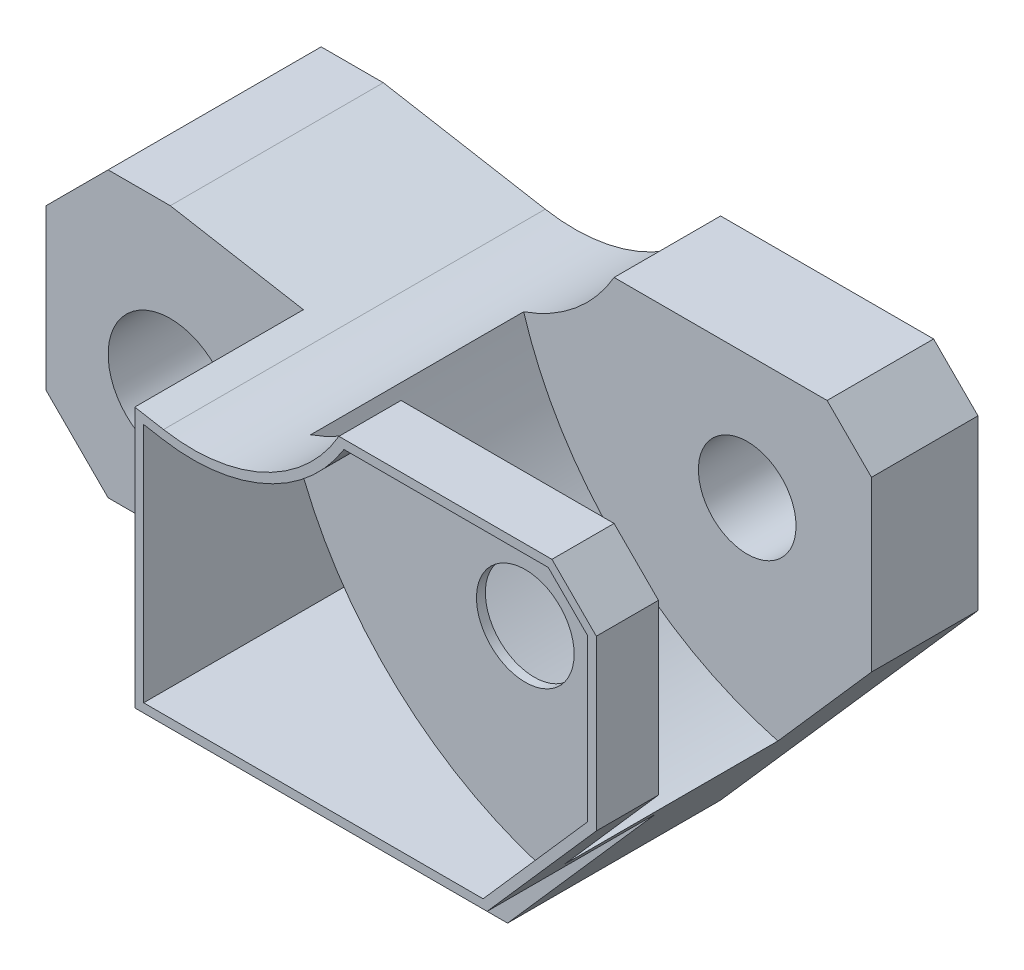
from build123d import *

# Parameters (mm, degrees)
SKETCH_1_R          = 7
EXTRUDE_1_DEPTH     = 43
CUT_EXTRUDE_START   = -19
SKETCH_2_R          = 7
CUT_EXTRUDE_1_DEPTH = 19
SKETCH_2_4_R        = 5.5
CUT_EXTRUDE_2_DEPTH = 87.180044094
CUT_EXTRUDE_START_2 = -7
SKETCH_2_5_R        = 5.5
CUT_EXTRUDE_3_DEPTH = 24
SKETCH_3_R          = 5.5
CUT_EXTRUDE_4_DEPTH = 6
CUT_EXTRUDE_5_DEPTH = 31


with BuildPart() as part:
    # Sketch 1 → Extrude 1 (new body)
    with BuildSketch(Plane.XY):
        with BuildLine():
            Line((21.066626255, -14), (-7, -14))
            Line((-7, -14), (-14, -7))
            Line((-14, -7), (-14, 11))
            Line((-14, 11), (-7, 18))
            Line((-7, 18), (0, 18))
            Line((0, 18), (18.243084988, 14.783251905))
            ThreePointArc((18.243084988, 14.783251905), (29.574972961, 16.276069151), (38, 24))
            Line((38, 24), (62, 24))
            Line((62, 24), (67, 19))
            Line((67, 19), (67, 0))
            Line((67, 0), (38, -33))
            Line((38, -33), (32.788067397, -33))
            ThreePointArc((32.788067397, -33), (28.3490952, -26.115672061), (26.012264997, -18.264705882))
            ThreePointArc((26.012264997, -18.264705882), (24.331862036, -15.213413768), (21.066626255, -14))
        make_face()
        Circle(SKETCH_1_R, mode=Mode.SUBTRACT)
    extrude(amount=EXTRUDE_1_DEPTH)

    # Sketch 2 → Cut-Extrude 1 (cut)
    # profile 1 of 2: a face of its own
    with BuildSketch(Plane.XY.offset(43).offset(CUT_EXTRUDE_START)):
        with BuildLine():
            Line((54.696969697, -14), (21.066626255, -14))
            ThreePointArc((21.066626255, -14), (24.331862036, -15.213413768), (26.012264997, -18.264705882))
            ThreePointArc((26.012264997, -18.264705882), (28.3490952, -26.115672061), (32.788067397, -33))
            Line((32.788067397, -33), (38, -33))
            Line((38, -33), (54.696969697, -14))
        make_face()
    # profile 2 of 2: a face of its own
    with BuildSketch(Plane.XY.offset(43).offset(CUT_EXTRUDE_START)):
        Polygon((-7, -14), (15, -14), (15, 15.355095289), (0, 18), (-7, 18), (-14, 11), (-14, -7), align=None)
        Circle(SKETCH_2_R, mode=Mode.SUBTRACT)
    extrude(amount=CUT_EXTRUDE_1_DEPTH, mode=Mode.SUBTRACT)

    # Sketch 2_4 → Cut-Extrude 2 (cut, through all)
    with BuildSketch(Plane.XY.offset(43)):
        with Locations((53, 10)):
            Circle(SKETCH_2_4_R)
    extrude(amount=-CUT_EXTRUDE_2_DEPTH, mode=Mode.SUBTRACT)

    # Sketch 2_5 → Cut-Extrude 3 (cut)
    with BuildSketch(Plane.XY.offset(43).offset(CUT_EXTRUDE_START_2)):
        with BuildLine():
            ThreePointArc((38, 24), (33.665353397, 18.864697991), (27.814145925, 15.559571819))
            ThreePointArc((27.814145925, 15.559571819), (38.571435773, -1.922853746), (56.454545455, -12))
            Line((56.454545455, -12), (67, 0))
            Line((67, 0), (67, 19))
            Line((67, 19), (62, 24))
            Line((62, 24), (38, 24))
        make_face()
        with Locations((53, 10)):
            Circle(SKETCH_2_5_R, mode=Mode.SUBTRACT)
    extrude(amount=-CUT_EXTRUDE_3_DEPTH, mode=Mode.SUBTRACT)

    # Sketch 3 → Cut-Extrude 4 (cut)
    # profile 1 of 2: a face of its own
    with BuildSketch(Plane.XY.offset(43)):
        with BuildLine():
            ThreePointArc((38.567775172, 23), (34.06779627, 17.902471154), (28.120050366, 14.607182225))
            ThreePointArc((28.120050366, 14.607182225), (38.532253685, -1.885100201), (55.386692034, -11.700255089))
            Line((55.386692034, -11.700255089), (66, 0.376957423))
            Line((66, 0.376957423), (66, 18.585786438))
            Line((66, 18.585786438), (61.585786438, 23))
            Line((61.585786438, 23), (38.567775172, 23))
        make_face()
        with Locations((53, 10)):
            Circle(SKETCH_3_R, mode=Mode.SUBTRACT)
    # profile 2 of 2: a face of its own
    with BuildSketch(Plane.XY.offset(43)):
        with BuildLine():
            ThreePointArc((55.386692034, -11.700255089), (38.532253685, -1.885100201), (28.120050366, 14.607182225))
            ThreePointArc((28.120050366, 14.607182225), (27.645770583, 14.448631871), (27.16767498, 14.301989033))
            ThreePointArc((27.16767498, 14.301989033), (37.667497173, -2.439393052), (54.661045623, -12.52599066))
            Line((54.661045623, -12.52599066), (55.386692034, -11.700255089))
        make_face()
    extrude(amount=-CUT_EXTRUDE_4_DEPTH, mode=Mode.SUBTRACT)

    # Sketch 3_3 → Cut-Extrude 5 (cut)
    with BuildSketch(Plane.XY.offset(43)):
        with BuildLine():
            ThreePointArc((54.661045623, -12.52599066), (37.667497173, -2.439393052), (27.16767498, 14.301989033))
            ThreePointArc((27.16767498, 14.301989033), (22.647615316, 13.525160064), (18.06943681, 13.798444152))
            Line((18.06943681, 13.798444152), (16, 14.163341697))
            Line((16, 14.163341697), (16, -13))
            Line((16, -13), (54.244491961, -13))
            Line((54.244491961, -13), (54.661045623, -12.52599066))
        make_face()
    extrude(amount=-CUT_EXTRUDE_5_DEPTH, mode=Mode.SUBTRACT)


solid = part.part
